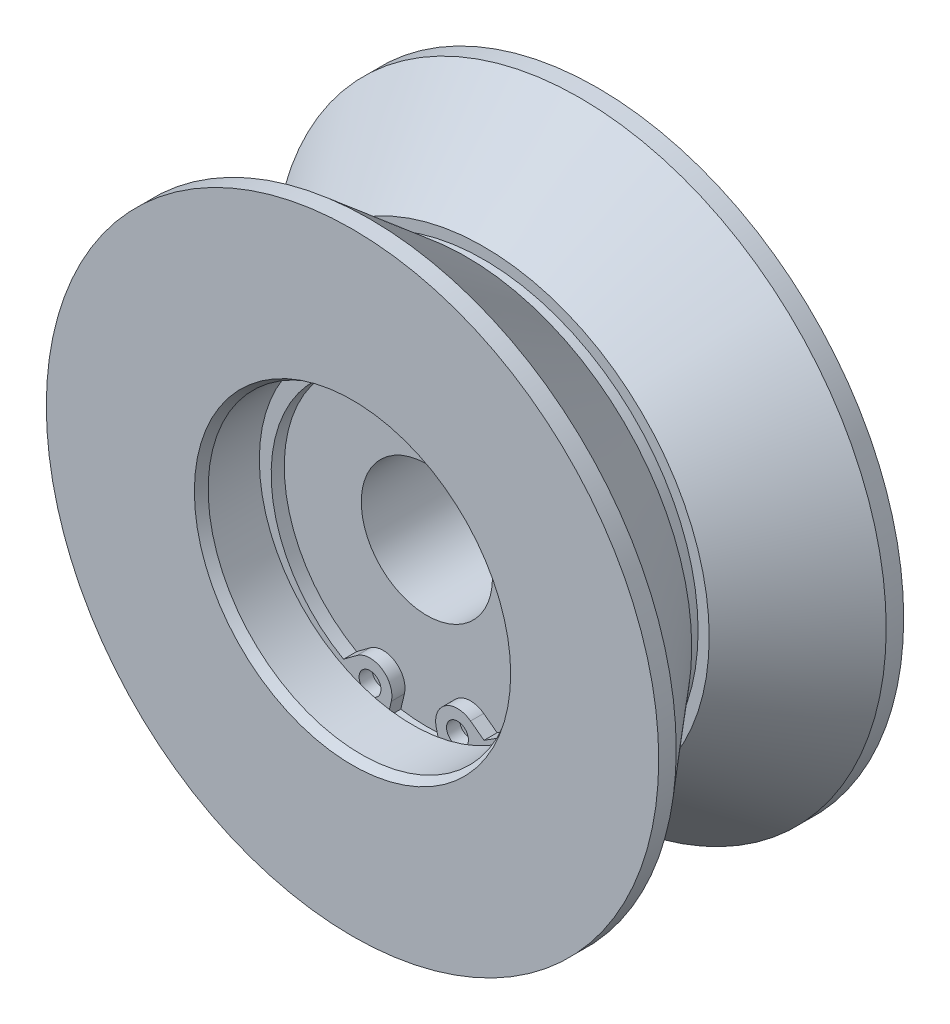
ISO-10303-21;
HEADER;
FILE_DESCRIPTION(('STEP AP214'),'2;1');
FILE_NAME('part.step','',(''),(''),'','','');
FILE_SCHEMA(('AUTOMOTIVE_DESIGN { 1 0 10303 214 1 1 1 1 }'));
ENDSEC;
DATA;
#1=APPLICATION_CONTEXT('core data for automotive mechanical design processes');
#2=APPLICATION_PROTOCOL_DEFINITION('international standard','automotive_design',2000,#1);
#3=PRODUCT_CONTEXT('',#1,'mechanical');
#4=PRODUCT('Part','Part','',(#3));
#5=PRODUCT_RELATED_PRODUCT_CATEGORY('part','',(#4));
#6=PRODUCT_DEFINITION_FORMATION('','',#4);
#7=PRODUCT_DEFINITION_CONTEXT('part definition',#1,'design');
#8=PRODUCT_DEFINITION('design','',#6,#7);
#9=PRODUCT_DEFINITION_SHAPE('','',#8);
#10=(LENGTH_UNIT() NAMED_UNIT(*) SI_UNIT(.MILLI.,.METRE.));
#11=(NAMED_UNIT(*) PLANE_ANGLE_UNIT() SI_UNIT($,.RADIAN.));
#12=(NAMED_UNIT(*) SI_UNIT($,.STERADIAN.) SOLID_ANGLE_UNIT());
#13=UNCERTAINTY_MEASURE_WITH_UNIT(LENGTH_MEASURE(1.E-05),#10,'distance_accuracy_value','');
#14=(GEOMETRIC_REPRESENTATION_CONTEXT(3) GLOBAL_UNCERTAINTY_ASSIGNED_CONTEXT((#13)) GLOBAL_UNIT_ASSIGNED_CONTEXT((#10,
#11,#12)) REPRESENTATION_CONTEXT('',''));
#15=CARTESIAN_POINT('',(0.,0.,0.));
#16=DIRECTION('',(0.,0.,1.));
#17=DIRECTION('',(1.,0.,0.));
#18=AXIS2_PLACEMENT_3D('',#15,#16,#17);
#19=CARTESIAN_POINT('',(0.,-0.9,7.1));
#20=DIRECTION('',(0.,0.,1.));
#21=DIRECTION('',(-1.,0.,0.));
#22=AXIS2_PLACEMENT_3D('',#19,#20,#21);
#23=CYLINDRICAL_SURFACE('',#22,16.3);
#24=CARTESIAN_POINT('',(0.,-0.9,7.));
#25=DIRECTION('',(0.,0.,1.));
#26=DIRECTION('',(1.,0.,0.));
#27=AXIS2_PLACEMENT_3D('',#24,#25,#26);
#28=CIRCLE('',#27,16.3);
#29=CARTESIAN_POINT('',(-8.02922574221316,-15.0852576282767,7.));
#30=VERTEX_POINT('',#29);
#31=CARTESIAN_POINT('',(8.02922574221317,-15.0852576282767,7.));
#32=VERTEX_POINT('',#31);
#33=EDGE_CURVE('E225',#30,#32,#28,.F.);
#34=ORIENTED_EDGE('',*,*,#33,.F.);
#35=DIRECTION('',(0.,0.,-1.));
#36=VECTOR('',#35,1.);
#37=CARTESIAN_POINT('',(-8.02922574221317,-15.0852576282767,7.1));
#38=LINE('',#37,#36);
#39=CARTESIAN_POINT('',(-8.02922574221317,-15.0852576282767,5.5));
#40=VERTEX_POINT('',#39);
#41=EDGE_CURVE('E180',#30,#40,#38,.T.);
#42=ORIENTED_EDGE('',*,*,#41,.T.);
#43=CARTESIAN_POINT('',(0.,-0.9,5.5));
#44=DIRECTION('',(0.,0.,-1.));
#45=DIRECTION('',(0.,-1.,0.));
#46=AXIS2_PLACEMENT_3D('',#43,#44,#45);
#47=CIRCLE('',#46,16.3);
#48=CARTESIAN_POINT('',(8.02922574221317,-15.0852576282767,5.5));
#49=VERTEX_POINT('',#48);
#50=EDGE_CURVE('E183',#40,#49,#47,.T.);
#51=ORIENTED_EDGE('',*,*,#50,.T.);
#52=DIRECTION('',(0.,0.,-1.));
#53=VECTOR('',#52,1.);
#54=CARTESIAN_POINT('',(8.02922574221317,-15.0852576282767,7.1));
#55=LINE('',#54,#53);
#56=EDGE_CURVE('E176',#32,#49,#55,.T.);
#57=ORIENTED_EDGE('',*,*,#56,.F.);
#58=EDGE_LOOP('',(#34,#42,#51,#57));
#59=FACE_BOUND('',#58,.T.);
#60=ADVANCED_FACE('F14',(#59),#23,.F.);
#61=CARTESIAN_POINT('',(6.49138441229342,-13.9421779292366,7.1));
#62=DIRECTION('',(-0.596553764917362,-0.802573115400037,0.));
#63=DIRECTION('',(-0.802573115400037,0.596553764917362,0.));
#64=AXIS2_PLACEMENT_3D('',#61,#62,#63);
#65=PLANE('',#64);
#66=DIRECTION('',(-0.802573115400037,0.596553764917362,0.));
#67=VECTOR('',#66,1.);
#68=CARTESIAN_POINT('',(6.49138441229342,-13.9421779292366,7.));
#69=LINE('',#68,#67);
#70=CARTESIAN_POINT('',(6.49138441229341,-13.9421779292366,7.));
#71=VERTEX_POINT('',#70);
#72=EDGE_CURVE('E223',#32,#71,#69,.T.);
#73=ORIENTED_EDGE('',*,*,#72,.F.);
#74=ORIENTED_EDGE('',*,*,#56,.T.);
#75=DIRECTION('',(-0.802573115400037,0.596553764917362,0.));
#76=VECTOR('',#75,1.);
#77=CARTESIAN_POINT('',(6.49138441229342,-13.9421779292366,5.5));
#78=LINE('',#77,#76);
#79=CARTESIAN_POINT('',(6.49138441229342,-13.9421779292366,5.5));
#80=VERTEX_POINT('',#79);
#81=EDGE_CURVE('E179',#49,#80,#78,.T.);
#82=ORIENTED_EDGE('',*,*,#81,.T.);
#83=DIRECTION('',(0.,0.,-1.));
#84=VECTOR('',#83,1.);
#85=CARTESIAN_POINT('',(6.49138441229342,-13.9421779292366,7.1));
#86=LINE('',#85,#84);
#87=EDGE_CURVE('E174',#71,#80,#86,.T.);
#88=ORIENTED_EDGE('',*,*,#87,.F.);
#89=EDGE_LOOP('',(#73,#74,#82,#88));
#90=FACE_BOUND('',#89,.T.);
#91=ADVANCED_FACE('F206',(#90),#65,.F.);
#92=CARTESIAN_POINT('',(5.,-15.9486107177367,7.1));
#93=DIRECTION('',(0.,0.,1.));
#94=DIRECTION('',(-1.,0.,0.));
#95=AXIS2_PLACEMENT_3D('',#92,#93,#94);
#96=CYLINDRICAL_SURFACE('',#95,2.5);
#97=DIRECTION('',(0.,0.,-1.));
#98=VECTOR('',#97,1.);
#99=CARTESIAN_POINT('',(2.5678231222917,-16.526983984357,7.1));
#100=LINE('',#99,#98);
#101=CARTESIAN_POINT('',(2.5678231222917,-16.526983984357,7.));
#102=VERTEX_POINT('',#101);
#103=CARTESIAN_POINT('',(2.5678231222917,-16.526983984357,5.5));
#104=VERTEX_POINT('',#103);
#105=EDGE_CURVE('E186',#102,#104,#100,.T.);
#106=ORIENTED_EDGE('',*,*,#105,.F.);
#107=CARTESIAN_POINT('',(5.,-15.9486107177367,7.));
#108=DIRECTION('',(0.,0.,1.));
#109=DIRECTION('',(1.,0.,0.));
#110=AXIS2_PLACEMENT_3D('',#107,#108,#109);
#111=CIRCLE('',#110,2.5);
#112=EDGE_CURVE('E222',#102,#71,#111,.F.);
#113=ORIENTED_EDGE('',*,*,#112,.T.);
#114=ORIENTED_EDGE('',*,*,#87,.T.);
#115=CARTESIAN_POINT('',(5.,-15.9486107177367,5.5));
#116=DIRECTION('',(0.,0.,1.));
#117=DIRECTION('',(1.,0.,0.));
#118=AXIS2_PLACEMENT_3D('',#115,#116,#117);
#119=CIRCLE('',#118,2.5);
#120=EDGE_CURVE('E113',#80,#104,#119,.T.);
#121=ORIENTED_EDGE('',*,*,#120,.T.);
#122=EDGE_LOOP('',(#106,#113,#114,#121));
#123=FACE_BOUND('',#122,.T.);
#124=ADVANCED_FACE('F221',(#123),#96,.T.);
#125=CARTESIAN_POINT('',(-2.56782312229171,-16.526983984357,7.1));
#126=DIRECTION('',(-0.97287075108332,0.231349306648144,0.));
#127=DIRECTION('',(0.,0.,1.));
#128=AXIS2_PLACEMENT_3D('',#125,#126,#127);
#129=PLANE('',#128);
#130=DIRECTION('',(0.231349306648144,0.97287075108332,0.));
#131=VECTOR('',#130,1.);
#132=CARTESIAN_POINT('',(-2.56782312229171,-16.526983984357,7.));
#133=LINE('',#132,#131);
#134=CARTESIAN_POINT('',(-2.97957431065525,-18.2584812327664,7.));
#135=VERTEX_POINT('',#134);
#136=CARTESIAN_POINT('',(-2.5678231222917,-16.526983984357,7.));
#137=VERTEX_POINT('',#136);
#138=EDGE_CURVE('E89',#135,#137,#133,.T.);
#139=ORIENTED_EDGE('',*,*,#138,.F.);
#140=DIRECTION('',(0.,0.,1.));
#141=VECTOR('',#140,1.);
#142=CARTESIAN_POINT('',(-2.97957431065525,-18.2584812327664,17.6183293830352));
#143=LINE('',#142,#141);
#144=CARTESIAN_POINT('',(-2.97957431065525,-18.2584812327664,5.5));
#145=VERTEX_POINT('',#144);
#146=EDGE_CURVE('E22',#145,#135,#143,.T.);
#147=ORIENTED_EDGE('',*,*,#146,.F.);
#148=DIRECTION('',(0.231349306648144,0.97287075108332,0.));
#149=VECTOR('',#148,1.);
#150=CARTESIAN_POINT('',(-2.56782312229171,-16.526983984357,5.5));
#151=LINE('',#150,#149);
#152=CARTESIAN_POINT('',(-2.56782312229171,-16.526983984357,5.5));
#153=VERTEX_POINT('',#152);
#154=EDGE_CURVE('E35',#145,#153,#151,.T.);
#155=ORIENTED_EDGE('',*,*,#154,.T.);
#156=DIRECTION('',(0.,0.,-1.));
#157=VECTOR('',#156,1.);
#158=CARTESIAN_POINT('',(-2.56782312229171,-16.526983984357,7.1));
#159=LINE('',#158,#157);
#160=EDGE_CURVE('E99',#137,#153,#159,.T.);
#161=ORIENTED_EDGE('',*,*,#160,.F.);
#162=EDGE_LOOP('',(#139,#147,#155,#161));
#163=FACE_BOUND('',#162,.T.);
#164=ADVANCED_FACE('F98',(#163),#129,.F.);
#165=CARTESIAN_POINT('',(-6.49138441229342,-13.9421779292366,7.1));
#166=DIRECTION('',(0.596553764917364,-0.802573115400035,0.));
#167=DIRECTION('',(0.,0.,-1.));
#168=AXIS2_PLACEMENT_3D('',#165,#166,#167);
#169=PLANE('',#168);
#170=DIRECTION('',(-0.802573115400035,-0.596553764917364,0.));
#171=VECTOR('',#170,1.);
#172=CARTESIAN_POINT('',(-6.49138441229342,-13.9421779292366,7.));
#173=LINE('',#172,#171);
#174=CARTESIAN_POINT('',(-6.49138441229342,-13.9421779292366,7.));
#175=VERTEX_POINT('',#174);
#176=EDGE_CURVE('E230',#175,#30,#173,.T.);
#177=ORIENTED_EDGE('',*,*,#176,.F.);
#178=DIRECTION('',(0.,0.,-1.));
#179=VECTOR('',#178,1.);
#180=CARTESIAN_POINT('',(-6.49138441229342,-13.9421779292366,7.1));
#181=LINE('',#180,#179);
#182=CARTESIAN_POINT('',(-6.49138441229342,-13.9421779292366,5.5));
#183=VERTEX_POINT('',#182);
#184=EDGE_CURVE('E109',#175,#183,#181,.T.);
#185=ORIENTED_EDGE('',*,*,#184,.T.);
#186=DIRECTION('',(-0.802573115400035,-0.596553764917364,0.));
#187=VECTOR('',#186,1.);
#188=CARTESIAN_POINT('',(-6.49138441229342,-13.9421779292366,5.5));
#189=LINE('',#188,#187);
#190=EDGE_CURVE('E105',#183,#40,#189,.T.);
#191=ORIENTED_EDGE('',*,*,#190,.T.);
#192=ORIENTED_EDGE('',*,*,#41,.F.);
#193=EDGE_LOOP('',(#177,#185,#191,#192));
#194=FACE_BOUND('',#193,.T.);
#195=ADVANCED_FACE('F245',(#194),#169,.F.);
#196=CARTESIAN_POINT('',(-5.,-15.9486107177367,7.1));
#197=DIRECTION('',(0.,0.,1.));
#198=DIRECTION('',(-1.,0.,0.));
#199=AXIS2_PLACEMENT_3D('',#196,#197,#198);
#200=CYLINDRICAL_SURFACE('',#199,2.5);
#201=ORIENTED_EDGE('',*,*,#184,.F.);
#202=CARTESIAN_POINT('',(-5.,-15.9486107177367,7.));
#203=DIRECTION('',(0.,0.,1.));
#204=DIRECTION('',(1.,0.,0.));
#205=AXIS2_PLACEMENT_3D('',#202,#203,#204);
#206=CIRCLE('',#205,2.5);
#207=EDGE_CURVE('E101',#175,#137,#206,.F.);
#208=ORIENTED_EDGE('',*,*,#207,.T.);
#209=ORIENTED_EDGE('',*,*,#160,.T.);
#210=CARTESIAN_POINT('',(-5.,-15.9486107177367,5.5));
#211=DIRECTION('',(0.,0.,1.));
#212=DIRECTION('',(-1.,0.,0.));
#213=AXIS2_PLACEMENT_3D('',#210,#211,#212);
#214=CIRCLE('',#213,2.5);
#215=EDGE_CURVE('E170',#153,#183,#214,.T.);
#216=ORIENTED_EDGE('',*,*,#215,.T.);
#217=EDGE_LOOP('',(#201,#208,#209,#216));
#218=FACE_BOUND('',#217,.T.);
#219=ADVANCED_FACE('F248',(#218),#200,.T.);
#220=CARTESIAN_POINT('',(2.5678231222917,-16.526983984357,7.1));
#221=DIRECTION('',(0.972870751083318,0.231349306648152,0.));
#222=DIRECTION('',(0.,0.,-1.));
#223=AXIS2_PLACEMENT_3D('',#220,#221,#222);
#224=PLANE('',#223);
#225=DIRECTION('',(0.231349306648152,-0.972870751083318,0.));
#226=VECTOR('',#225,1.);
#227=CARTESIAN_POINT('',(2.5678231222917,-16.526983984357,7.));
#228=LINE('',#227,#226);
#229=CARTESIAN_POINT('',(2.97957431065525,-18.2584812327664,7.));
#230=VERTEX_POINT('',#229);
#231=EDGE_CURVE('E92',#102,#230,#228,.T.);
#232=ORIENTED_EDGE('',*,*,#231,.F.);
#233=ORIENTED_EDGE('',*,*,#105,.T.);
#234=DIRECTION('',(0.231349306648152,-0.972870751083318,0.));
#235=VECTOR('',#234,1.);
#236=CARTESIAN_POINT('',(2.5678231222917,-16.526983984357,5.5));
#237=LINE('',#236,#235);
#238=CARTESIAN_POINT('',(2.97957431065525,-18.2584812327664,5.5));
#239=VERTEX_POINT('',#238);
#240=EDGE_CURVE('E184',#104,#239,#237,.T.);
#241=ORIENTED_EDGE('',*,*,#240,.T.);
#242=DIRECTION('',(0.,0.,1.));
#243=VECTOR('',#242,1.);
#244=CARTESIAN_POINT('',(2.97957431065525,-18.2584812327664,17.6183293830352));
#245=LINE('',#244,#243);
#246=EDGE_CURVE('E9',#230,#239,#245,.F.);
#247=ORIENTED_EDGE('',*,*,#246,.F.);
#248=EDGE_LOOP('',(#232,#233,#241,#247));
#249=FACE_BOUND('',#248,.T.);
#250=ADVANCED_FACE('F250',(#249),#224,.F.);
#251=CARTESIAN_POINT('',(0.,0.,17.6183293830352));
#252=DIRECTION('',(0.,0.,1.));
#253=DIRECTION('',(1.,0.,0.));
#254=AXIS2_PLACEMENT_3D('',#251,#252,#253);
#255=CYLINDRICAL_SURFACE('',#254,24.5);
#256=CARTESIAN_POINT('',(0.,0.,1.));
#257=DIRECTION('',(0.,0.,1.));
#258=DIRECTION('',(1.,0.,0.));
#259=AXIS2_PLACEMENT_3D('',#256,#257,#258);
#260=CIRCLE('',#259,24.5);
#261=CARTESIAN_POINT('',(24.5,0.,1.));
#262=VERTEX_POINT('',#261);
#263=EDGE_CURVE('E147',#262,#262,#260,.T.);
#264=ORIENTED_EDGE('',*,*,#263,.F.);
#265=EDGE_LOOP('',(#264));
#266=FACE_BOUND('',#265,.T.);
#267=CARTESIAN_POINT('',(0.,0.,-1.));
#268=DIRECTION('',(0.,0.,1.));
#269=DIRECTION('',(1.,0.,0.));
#270=AXIS2_PLACEMENT_3D('',#267,#268,#269);
#271=CIRCLE('',#270,24.5);
#272=CARTESIAN_POINT('',(24.5,0.,-1.));
#273=VERTEX_POINT('',#272);
#274=EDGE_CURVE('E150',#273,#273,#271,.T.);
#275=ORIENTED_EDGE('',*,*,#274,.T.);
#276=EDGE_LOOP('',(#275));
#277=FACE_BOUND('',#276,.T.);
#278=ADVANCED_FACE('F257',(#266,#277),#255,.T.);
#279=CARTESIAN_POINT('',(0.,24.5,1.));
#280=DIRECTION('',(0.,0.,1.));
#281=DIRECTION('',(1.,0.,0.));
#282=AXIS2_PLACEMENT_3D('',#279,#280,#281);
#283=PLANE('',#282);
#284=CARTESIAN_POINT('',(0.,0.,1.));
#285=DIRECTION('',(0.,0.,1.));
#286=DIRECTION('',(1.,0.,0.));
#287=AXIS2_PLACEMENT_3D('',#284,#285,#286);
#288=CIRCLE('',#287,25.76990405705);
#289=CARTESIAN_POINT('',(25.76990405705,0.,1.));
#290=VERTEX_POINT('',#289);
#291=EDGE_CURVE('E144',#290,#290,#288,.T.);
#292=ORIENTED_EDGE('',*,*,#291,.F.);
#293=EDGE_LOOP('',(#292));
#294=FACE_BOUND('',#293,.T.);
#295=ORIENTED_EDGE('',*,*,#263,.T.);
#296=EDGE_LOOP('',(#295));
#297=FACE_BOUND('',#296,.T.);
#298=ADVANCED_FACE('F345',(#294,#297),#283,.F.);
#299=CARTESIAN_POINT('',(0.,24.5,-1.));
#300=DIRECTION('',(0.,0.,-1.));
#301=DIRECTION('',(-1.,0.,0.));
#302=AXIS2_PLACEMENT_3D('',#299,#300,#301);
#303=PLANE('',#302);
#304=ORIENTED_EDGE('',*,*,#274,.F.);
#305=EDGE_LOOP('',(#304));
#306=FACE_BOUND('',#305,.T.);
#307=CARTESIAN_POINT('',(0.,0.,-1.));
#308=DIRECTION('',(0.,0.,1.));
#309=DIRECTION('',(1.,0.,0.));
#310=AXIS2_PLACEMENT_3D('',#307,#308,#309);
#311=CIRCLE('',#310,25.76990405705);
#312=CARTESIAN_POINT('',(25.76990405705,0.,-1.));
#313=VERTEX_POINT('',#312);
#314=EDGE_CURVE('E153',#313,#313,#311,.T.);
#315=ORIENTED_EDGE('',*,*,#314,.T.);
#316=EDGE_LOOP('',(#315));
#317=FACE_BOUND('',#316,.T.);
#318=ADVANCED_FACE('F355',(#306,#317),#303,.F.);
#319=CARTESIAN_POINT('',(0.,0.,1.));
#320=DIRECTION('',(0.,0.,1.));
#321=DIRECTION('',(1.,0.,0.));
#322=AXIS2_PLACEMENT_3D('',#319,#320,#321);
#323=CONICAL_SURFACE('',#322,25.76990405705,0.69813170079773);
#324=CARTESIAN_POINT('',(0.,0.,12.));
#325=DIRECTION('',(0.,0.,1.));
#326=DIRECTION('',(1.,0.,0.));
#327=AXIS2_PLACEMENT_3D('',#324,#325,#326);
#328=CIRCLE('',#327,35.);
#329=CARTESIAN_POINT('',(35.,0.,12.));
#330=VERTEX_POINT('',#329);
#331=EDGE_CURVE('E141',#330,#330,#328,.T.);
#332=ORIENTED_EDGE('',*,*,#331,.F.);
#333=EDGE_LOOP('',(#332));
#334=FACE_BOUND('',#333,.T.);
#335=ORIENTED_EDGE('',*,*,#291,.T.);
#336=EDGE_LOOP('',(#335));
#337=FACE_BOUND('',#336,.T.);
#338=ADVANCED_FACE('F365',(#334,#337),#323,.T.);
#339=CARTESIAN_POINT('',(0.,0.,-12.));
#340=DIRECTION('',(0.,0.,-1.));
#341=DIRECTION('',(-1.,0.,0.));
#342=AXIS2_PLACEMENT_3D('',#339,#340,#341);
#343=CONICAL_SURFACE('',#342,35.,0.69813170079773);
#344=ORIENTED_EDGE('',*,*,#314,.F.);
#345=EDGE_LOOP('',(#344));
#346=FACE_BOUND('',#345,.T.);
#347=CARTESIAN_POINT('',(0.,0.,-12.));
#348=DIRECTION('',(0.,0.,1.));
#349=DIRECTION('',(1.,0.,0.));
#350=AXIS2_PLACEMENT_3D('',#347,#348,#349);
#351=CIRCLE('',#350,35.);
#352=CARTESIAN_POINT('',(35.,0.,-12.));
#353=VERTEX_POINT('',#352);
#354=EDGE_CURVE('E155',#353,#353,#351,.T.);
#355=ORIENTED_EDGE('',*,*,#354,.T.);
#356=EDGE_LOOP('',(#355));
#357=FACE_BOUND('',#356,.T.);
#358=ADVANCED_FACE('F375',(#346,#357),#343,.T.);
#359=CARTESIAN_POINT('',(0.,0.,17.6183293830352));
#360=DIRECTION('',(0.,0.,1.));
#361=DIRECTION('',(1.,0.,0.));
#362=AXIS2_PLACEMENT_3D('',#359,#360,#361);
#363=CYLINDRICAL_SURFACE('',#362,35.);
#364=CARTESIAN_POINT('',(0.,0.,14.));
#365=DIRECTION('',(0.,0.,1.));
#366=DIRECTION('',(1.,0.,0.));
#367=AXIS2_PLACEMENT_3D('',#364,#365,#366);
#368=CIRCLE('',#367,35.);
#369=CARTESIAN_POINT('',(35.,0.,14.));
#370=VERTEX_POINT('',#369);
#371=EDGE_CURVE('E138',#370,#370,#368,.T.);
#372=ORIENTED_EDGE('',*,*,#371,.F.);
#373=EDGE_LOOP('',(#372));
#374=FACE_BOUND('',#373,.T.);
#375=ORIENTED_EDGE('',*,*,#331,.T.);
#376=EDGE_LOOP('',(#375));
#377=FACE_BOUND('',#376,.T.);
#378=ADVANCED_FACE('F385',(#374,#377),#363,.T.);
#379=CARTESIAN_POINT('',(0.,0.,17.6183293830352));
#380=DIRECTION('',(0.,0.,1.));
#381=DIRECTION('',(1.,0.,0.));
#382=AXIS2_PLACEMENT_3D('',#379,#380,#381);
#383=CYLINDRICAL_SURFACE('',#382,35.);
#384=ORIENTED_EDGE('',*,*,#354,.F.);
#385=EDGE_LOOP('',(#384));
#386=FACE_BOUND('',#385,.T.);
#387=CARTESIAN_POINT('',(0.,0.,-14.));
#388=DIRECTION('',(0.,0.,1.));
#389=DIRECTION('',(1.,0.,0.));
#390=AXIS2_PLACEMENT_3D('',#387,#388,#389);
#391=CIRCLE('',#390,35.);
#392=CARTESIAN_POINT('',(35.,0.,-14.));
#393=VERTEX_POINT('',#392);
#394=EDGE_CURVE('E115',#393,#393,#391,.T.);
#395=ORIENTED_EDGE('',*,*,#394,.T.);
#396=EDGE_LOOP('',(#395));
#397=FACE_BOUND('',#396,.T.);
#398=ADVANCED_FACE('F16',(#386,#397),#383,.T.);
#399=CARTESIAN_POINT('',(0.,35.,14.));
#400=DIRECTION('',(0.,0.,-1.));
#401=DIRECTION('',(-1.,0.,0.));
#402=AXIS2_PLACEMENT_3D('',#399,#400,#401);
#403=PLANE('',#402);
#404=CARTESIAN_POINT('',(0.,0.,14.));
#405=DIRECTION('',(0.,0.,1.));
#406=DIRECTION('',(1.,0.,0.));
#407=AXIS2_PLACEMENT_3D('',#404,#405,#406);
#408=CIRCLE('',#407,18.0773502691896);
#409=CARTESIAN_POINT('',(18.0773502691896,0.,14.));
#410=VERTEX_POINT('',#409);
#411=EDGE_CURVE('E135',#410,#410,#408,.T.);
#412=ORIENTED_EDGE('',*,*,#411,.F.);
#413=EDGE_LOOP('',(#412));
#414=FACE_BOUND('',#413,.T.);
#415=ORIENTED_EDGE('',*,*,#371,.T.);
#416=EDGE_LOOP('',(#415));
#417=FACE_BOUND('',#416,.T.);
#418=ADVANCED_FACE('F403',(#414,#417),#403,.F.);
#419=CARTESIAN_POINT('',(0.,14.5,-14.));
#420=DIRECTION('',(0.,0.,1.));
#421=DIRECTION('',(1.,0.,0.));
#422=AXIS2_PLACEMENT_3D('',#419,#420,#421);
#423=PLANE('',#422);
#424=ORIENTED_EDGE('',*,*,#394,.F.);
#425=EDGE_LOOP('',(#424));
#426=FACE_BOUND('',#425,.T.);
#427=CARTESIAN_POINT('',(0.,0.,-14.));
#428=DIRECTION('',(0.,0.,1.));
#429=DIRECTION('',(1.,0.,0.));
#430=AXIS2_PLACEMENT_3D('',#427,#428,#429);
#431=CIRCLE('',#430,14.5);
#432=CARTESIAN_POINT('',(14.5,0.,-14.));
#433=VERTEX_POINT('',#432);
#434=EDGE_CURVE('E118',#433,#433,#431,.T.);
#435=ORIENTED_EDGE('',*,*,#434,.T.);
#436=EDGE_LOOP('',(#435));
#437=FACE_BOUND('',#436,.T.);
#438=ADVANCED_FACE('F412',(#426,#437),#423,.F.);
#439=CARTESIAN_POINT('',(0.,0.,14.));
#440=DIRECTION('',(0.,0.,1.));
#441=DIRECTION('',(1.,0.,0.));
#442=AXIS2_PLACEMENT_3D('',#439,#440,#441);
#443=CONICAL_SURFACE('',#442,18.0773502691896,0.5235987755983);
#444=CARTESIAN_POINT('',(0.,0.,13.));
#445=DIRECTION('',(0.,0.,1.));
#446=DIRECTION('',(1.,0.,0.));
#447=AXIS2_PLACEMENT_3D('',#444,#445,#446);
#448=CIRCLE('',#447,17.5);
#449=CARTESIAN_POINT('',(17.5,0.,13.));
#450=VERTEX_POINT('',#449);
#451=EDGE_CURVE('E132',#450,#450,#448,.T.);
#452=ORIENTED_EDGE('',*,*,#451,.F.);
#453=EDGE_LOOP('',(#452));
#454=FACE_BOUND('',#453,.T.);
#455=ORIENTED_EDGE('',*,*,#411,.T.);
#456=EDGE_LOOP('',(#455));
#457=FACE_BOUND('',#456,.T.);
#458=ADVANCED_FACE('F422',(#454,#457),#443,.F.);
#459=CARTESIAN_POINT('',(0.,0.,17.6183293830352));
#460=DIRECTION('',(0.,0.,1.));
#461=DIRECTION('',(1.,0.,0.));
#462=AXIS2_PLACEMENT_3D('',#459,#460,#461);
#463=CYLINDRICAL_SURFACE('',#462,14.5);
#464=ORIENTED_EDGE('',*,*,#434,.F.);
#465=EDGE_LOOP('',(#464));
#466=FACE_BOUND('',#465,.T.);
#467=CARTESIAN_POINT('',(0.,0.,-5.5));
#468=DIRECTION('',(0.,0.,1.));
#469=DIRECTION('',(1.,0.,0.));
#470=AXIS2_PLACEMENT_3D('',#467,#468,#469);
#471=CIRCLE('',#470,14.5);
#472=CARTESIAN_POINT('',(14.5,0.,-5.5));
#473=VERTEX_POINT('',#472);
#474=EDGE_CURVE('E122',#473,#473,#471,.T.);
#475=ORIENTED_EDGE('',*,*,#474,.T.);
#476=EDGE_LOOP('',(#475));
#477=FACE_BOUND('',#476,.T.);
#478=ADVANCED_FACE('F431',(#466,#477),#463,.F.);
#479=CARTESIAN_POINT('',(0.,0.,17.6183293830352));
#480=DIRECTION('',(0.,0.,1.));
#481=DIRECTION('',(1.,0.,0.));
#482=AXIS2_PLACEMENT_3D('',#479,#480,#481);
#483=CYLINDRICAL_SURFACE('',#482,17.5);
#484=ORIENTED_EDGE('',*,*,#451,.T.);
#485=EDGE_LOOP('',(#484));
#486=FACE_BOUND('',#485,.T.);
#487=CARTESIAN_POINT('',(0.,0.,7.15));
#488=DIRECTION('',(0.,0.,-1.));
#489=DIRECTION('',(-1.,0.,0.));
#490=AXIS2_PLACEMENT_3D('',#487,#488,#489);
#491=CIRCLE('',#490,17.5);
#492=CARTESIAN_POINT('',(-17.5,0.,7.15));
#493=VERTEX_POINT('',#492);
#494=EDGE_CURVE('E531',#493,#493,#491,.T.);
#495=ORIENTED_EDGE('',*,*,#494,.T.);
#496=EDGE_LOOP('',(#495));
#497=FACE_BOUND('',#496,.T.);
#498=ADVANCED_FACE('F441',(#486,#497),#483,.F.);
#499=CARTESIAN_POINT('',(0.,14.5,-5.5));
#500=DIRECTION('',(0.,0.,1.));
#501=DIRECTION('',(1.,0.,0.));
#502=AXIS2_PLACEMENT_3D('',#499,#500,#501);
#503=PLANE('',#502);
#504=ORIENTED_EDGE('',*,*,#474,.F.);
#505=EDGE_LOOP('',(#504));
#506=FACE_BOUND('',#505,.T.);
#507=CARTESIAN_POINT('',(0.,0.,-5.5));
#508=DIRECTION('',(0.,0.,1.));
#509=DIRECTION('',(1.,0.,0.));
#510=AXIS2_PLACEMENT_3D('',#507,#508,#509);
#511=CIRCLE('',#510,7.5);
#512=CARTESIAN_POINT('',(7.5,0.,-5.5));
#513=VERTEX_POINT('',#512);
#514=EDGE_CURVE('E125',#513,#513,#511,.T.);
#515=ORIENTED_EDGE('',*,*,#514,.T.);
#516=EDGE_LOOP('',(#515));
#517=FACE_BOUND('',#516,.T.);
#518=ADVANCED_FACE('F452',(#506,#517),#503,.F.);
#519=CARTESIAN_POINT('',(0.,0.,17.6183293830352));
#520=DIRECTION('',(0.,0.,1.));
#521=DIRECTION('',(1.,0.,0.));
#522=AXIS2_PLACEMENT_3D('',#519,#520,#521);
#523=CYLINDRICAL_SURFACE('',#522,18.5);
#524=CARTESIAN_POINT('',(0.,0.,7.15));
#525=DIRECTION('',(0.,0.,-1.));
#526=DIRECTION('',(-1.,0.,0.));
#527=AXIS2_PLACEMENT_3D('',#524,#525,#526);
#528=CIRCLE('',#527,18.5);
#529=CARTESIAN_POINT('',(-18.5,0.,7.15));
#530=VERTEX_POINT('',#529);
#531=EDGE_CURVE('E94',#530,#530,#528,.T.);
#532=ORIENTED_EDGE('',*,*,#531,.F.);
#533=EDGE_LOOP('',(#532));
#534=FACE_BOUND('',#533,.T.);
#535=CARTESIAN_POINT('',(0.,0.,7.));
#536=DIRECTION('',(0.,0.,1.));
#537=DIRECTION('',(1.,0.,0.));
#538=AXIS2_PLACEMENT_3D('',#535,#536,#537);
#539=CIRCLE('',#538,18.5);
#540=EDGE_CURVE('E85',#230,#135,#539,.T.);
#541=ORIENTED_EDGE('',*,*,#540,.F.);
#542=ORIENTED_EDGE('',*,*,#246,.T.);
#543=CARTESIAN_POINT('',(0.,0.,5.5));
#544=DIRECTION('',(0.,0.,1.));
#545=DIRECTION('',(1.,0.,0.));
#546=AXIS2_PLACEMENT_3D('',#543,#544,#545);
#547=CIRCLE('',#546,18.5);
#548=EDGE_CURVE('E104',#145,#239,#547,.T.);
#549=ORIENTED_EDGE('',*,*,#548,.F.);
#550=ORIENTED_EDGE('',*,*,#146,.T.);
#551=EDGE_LOOP('',(#541,#542,#549,#550));
#552=FACE_BOUND('',#551,.T.);
#553=ADVANCED_FACE('F103',(#534,#552),#523,.F.);
#554=CARTESIAN_POINT('',(0.,0.,17.6183293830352));
#555=DIRECTION('',(0.,0.,1.));
#556=DIRECTION('',(1.,0.,0.));
#557=AXIS2_PLACEMENT_3D('',#554,#555,#556);
#558=CYLINDRICAL_SURFACE('',#557,7.5);
#559=ORIENTED_EDGE('',*,*,#514,.F.);
#560=EDGE_LOOP('',(#559));
#561=FACE_BOUND('',#560,.T.);
#562=CARTESIAN_POINT('',(0.,0.,5.5));
#563=DIRECTION('',(0.,0.,1.));
#564=DIRECTION('',(1.,0.,0.));
#565=AXIS2_PLACEMENT_3D('',#562,#563,#564);
#566=CIRCLE('',#565,7.5);
#567=CARTESIAN_POINT('',(7.5,0.,5.5));
#568=VERTEX_POINT('',#567);
#569=EDGE_CURVE('E128',#568,#568,#566,.T.);
#570=ORIENTED_EDGE('',*,*,#569,.T.);
#571=EDGE_LOOP('',(#570));
#572=FACE_BOUND('',#571,.T.);
#573=ADVANCED_FACE('F298',(#561,#572),#558,.F.);
#574=CARTESIAN_POINT('',(0.,7.5,5.5));
#575=DIRECTION('',(0.,0.,-1.));
#576=DIRECTION('',(-1.,0.,0.));
#577=AXIS2_PLACEMENT_3D('',#574,#575,#576);
#578=PLANE('',#577);
#579=ORIENTED_EDGE('',*,*,#569,.F.);
#580=EDGE_LOOP('',(#579));
#581=FACE_BOUND('',#580,.T.);
#582=ORIENTED_EDGE('',*,*,#548,.T.);
#583=ORIENTED_EDGE('',*,*,#240,.F.);
#584=ORIENTED_EDGE('',*,*,#120,.F.);
#585=ORIENTED_EDGE('',*,*,#81,.F.);
#586=ORIENTED_EDGE('',*,*,#50,.F.);
#587=ORIENTED_EDGE('',*,*,#190,.F.);
#588=ORIENTED_EDGE('',*,*,#215,.F.);
#589=ORIENTED_EDGE('',*,*,#154,.F.);
#590=EDGE_LOOP('',(#582,#583,#584,#585,#586,#587,#588,#589));
#591=FACE_BOUND('',#590,.T.);
#592=ADVANCED_FACE('F212',(#581,#591),#578,.F.);
#593=CARTESIAN_POINT('',(0.,0.,7.));
#594=DIRECTION('',(0.,0.,1.));
#595=DIRECTION('',(1.,0.,0.));
#596=AXIS2_PLACEMENT_3D('',#593,#594,#595);
#597=PLANE('',#596);
#598=ORIENTED_EDGE('',*,*,#138,.T.);
#599=ORIENTED_EDGE('',*,*,#207,.F.);
#600=ORIENTED_EDGE('',*,*,#176,.T.);
#601=ORIENTED_EDGE('',*,*,#33,.T.);
#602=ORIENTED_EDGE('',*,*,#72,.T.);
#603=ORIENTED_EDGE('',*,*,#112,.F.);
#604=ORIENTED_EDGE('',*,*,#231,.T.);
#605=ORIENTED_EDGE('',*,*,#540,.T.);
#606=EDGE_LOOP('',(#598,#599,#600,#601,#602,#603,#604,#605));
#607=FACE_BOUND('',#606,.T.);
#608=CARTESIAN_POINT('',(-5.,-15.9486107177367,7.));
#609=DIRECTION('',(0.,0.,1.));
#610=DIRECTION('',(1.,0.,0.));
#611=AXIS2_PLACEMENT_3D('',#608,#609,#610);
#612=CIRCLE('',#611,1.25);
#613=CARTESIAN_POINT('',(-3.75,-15.9486107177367,7.));
#614=VERTEX_POINT('',#613);
#615=EDGE_CURVE('E100',#614,#614,#612,.F.);
#616=ORIENTED_EDGE('',*,*,#615,.T.);
#617=EDGE_LOOP('',(#616));
#618=FACE_BOUND('',#617,.T.);
#619=CARTESIAN_POINT('',(5.,-15.9486107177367,7.));
#620=DIRECTION('',(0.,0.,1.));
#621=DIRECTION('',(1.,0.,0.));
#622=AXIS2_PLACEMENT_3D('',#619,#620,#621);
#623=CIRCLE('',#622,1.25);
#624=CARTESIAN_POINT('',(6.25,-15.9486107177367,7.));
#625=VERTEX_POINT('',#624);
#626=EDGE_CURVE('E119',#625,#625,#623,.F.);
#627=ORIENTED_EDGE('',*,*,#626,.T.);
#628=EDGE_LOOP('',(#627));
#629=FACE_BOUND('',#628,.T.);
#630=ADVANCED_FACE('F87',(#607,#618,#629),#597,.T.);
#631=CARTESIAN_POINT('',(-5.,-15.9486107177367,5.5));
#632=DIRECTION('',(0.,0.,-1.));
#633=DIRECTION('',(1.,0.,0.));
#634=AXIS2_PLACEMENT_3D('',#631,#632,#633);
#635=CIRCLE('',#634,1.25);
#636=CARTESIAN_POINT('',(-3.75,-15.9486107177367,5.5));
#637=VERTEX_POINT('',#636);
#638=EDGE_CURVE('E157',#637,#637,#635,.T.);
#639=ORIENTED_EDGE('',*,*,#638,.F.);
#640=EDGE_LOOP('',(#639));
#641=FACE_BOUND('',#640,.T.);
#642=ADVANCED_FACE('F280',(#641),#578,.F.);
#643=CARTESIAN_POINT('',(-5.,-15.9486107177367,7.1));
#644=DIRECTION('',(0.,0.,1.));
#645=DIRECTION('',(-1.,0.,0.));
#646=AXIS2_PLACEMENT_3D('',#643,#644,#645);
#647=CYLINDRICAL_SURFACE('',#646,1.25);
#648=ORIENTED_EDGE('',*,*,#638,.T.);
#649=EDGE_LOOP('',(#648));
#650=FACE_BOUND('',#649,.T.);
#651=ORIENTED_EDGE('',*,*,#615,.F.);
#652=EDGE_LOOP('',(#651));
#653=FACE_BOUND('',#652,.T.);
#654=ADVANCED_FACE('F278',(#650,#653),#647,.F.);
#655=CARTESIAN_POINT('',(5.,-15.9486107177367,5.5));
#656=DIRECTION('',(0.,0.,1.));
#657=DIRECTION('',(1.,0.,0.));
#658=AXIS2_PLACEMENT_3D('',#655,#656,#657);
#659=CIRCLE('',#658,1.25);
#660=CARTESIAN_POINT('',(6.25,-15.9486107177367,5.5));
#661=VERTEX_POINT('',#660);
#662=EDGE_CURVE('E189',#661,#661,#659,.T.);
#663=ORIENTED_EDGE('',*,*,#662,.T.);
#664=EDGE_LOOP('',(#663));
#665=FACE_BOUND('',#664,.T.);
#666=ADVANCED_FACE('F276',(#665),#578,.F.);
#667=CARTESIAN_POINT('',(5.,-15.9486107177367,7.1));
#668=DIRECTION('',(0.,0.,1.));
#669=DIRECTION('',(-1.,0.,0.));
#670=AXIS2_PLACEMENT_3D('',#667,#668,#669);
#671=CYLINDRICAL_SURFACE('',#670,1.25);
#672=ORIENTED_EDGE('',*,*,#662,.F.);
#673=EDGE_LOOP('',(#672));
#674=FACE_BOUND('',#673,.T.);
#675=ORIENTED_EDGE('',*,*,#626,.F.);
#676=EDGE_LOOP('',(#675));
#677=FACE_BOUND('',#676,.T.);
#678=ADVANCED_FACE('F273',(#674,#677),#671,.F.);
#679=CARTESIAN_POINT('',(0.,0.,7.15));
#680=DIRECTION('',(0.,0.,-1.));
#681=DIRECTION('',(-1.,0.,0.));
#682=AXIS2_PLACEMENT_3D('',#679,#680,#681);
#683=PLANE('',#682);
#684=ORIENTED_EDGE('',*,*,#531,.T.);
#685=EDGE_LOOP('',(#684));
#686=FACE_BOUND('',#685,.T.);
#687=ORIENTED_EDGE('',*,*,#494,.F.);
#688=EDGE_LOOP('',(#687));
#689=FACE_BOUND('',#688,.T.);
#690=ADVANCED_FACE('F275',(#686,#689),#683,.T.);
#691=CLOSED_SHELL('',(#60,#91,#124,#164,#195,#219,#250,#278,#298,#318,#338,#358,#378,#398,#418,
#438,#458,#478,#498,#518,#553,#573,#592,#630,#642,#654,#666,#678,#690));
#692=MANIFOLD_SOLID_BREP('B1',#691);
#693=ADVANCED_BREP_SHAPE_REPRESENTATION('',(#18,#692),#14);
#694=SHAPE_DEFINITION_REPRESENTATION(#9,#693);
ENDSEC;
END-ISO-10303-21;
